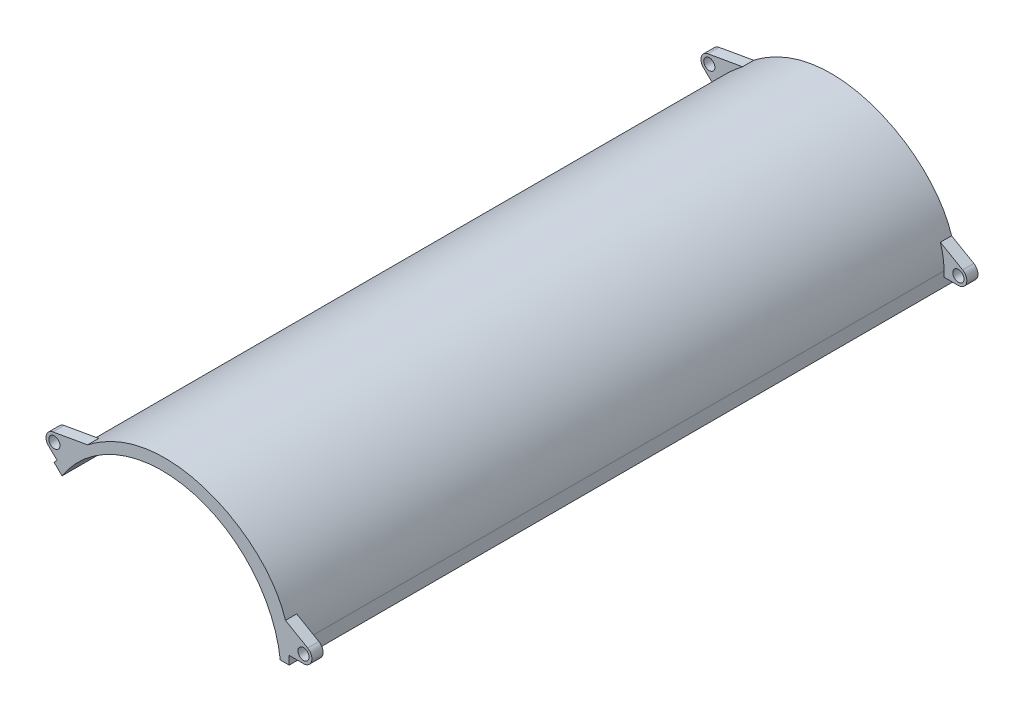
ISO-10303-21;
HEADER;
FILE_DESCRIPTION(('STEP AP214'),'2;1');
FILE_NAME('part.step','',(''),(''),'','','');
FILE_SCHEMA(('AUTOMOTIVE_DESIGN { 1 0 10303 214 1 1 1 1 }'));
ENDSEC;
DATA;
#1=APPLICATION_CONTEXT('core data for automotive mechanical design processes');
#2=APPLICATION_PROTOCOL_DEFINITION('international standard','automotive_design',2000,#1);
#3=PRODUCT_CONTEXT('',#1,'mechanical');
#4=PRODUCT('Part','Part','',(#3));
#5=PRODUCT_RELATED_PRODUCT_CATEGORY('part','',(#4));
#6=PRODUCT_DEFINITION_FORMATION('','',#4);
#7=PRODUCT_DEFINITION_CONTEXT('part definition',#1,'design');
#8=PRODUCT_DEFINITION('design','',#6,#7);
#9=PRODUCT_DEFINITION_SHAPE('','',#8);
#10=(LENGTH_UNIT() NAMED_UNIT(*) SI_UNIT(.MILLI.,.METRE.));
#11=(NAMED_UNIT(*) PLANE_ANGLE_UNIT() SI_UNIT($,.RADIAN.));
#12=(NAMED_UNIT(*) SI_UNIT($,.STERADIAN.) SOLID_ANGLE_UNIT());
#13=UNCERTAINTY_MEASURE_WITH_UNIT(LENGTH_MEASURE(1.E-05),#10,'distance_accuracy_value','');
#14=(GEOMETRIC_REPRESENTATION_CONTEXT(3) GLOBAL_UNCERTAINTY_ASSIGNED_CONTEXT((#13)) GLOBAL_UNIT_ASSIGNED_CONTEXT((#10,
#11,#12)) REPRESENTATION_CONTEXT('',''));
#15=CARTESIAN_POINT('',(0.,0.,0.));
#16=DIRECTION('',(0.,0.,1.));
#17=DIRECTION('',(1.,0.,0.));
#18=AXIS2_PLACEMENT_3D('',#15,#16,#17);
#19=CARTESIAN_POINT('',(252.5,1.52655665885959E-13,595.));
#20=DIRECTION('',(0.,0.,-1.));
#21=DIRECTION('',(-1.,0.,0.));
#22=AXIS2_PLACEMENT_3D('',#19,#20,#21);
#23=CYLINDRICAL_SURFACE('',#22,212.5);
#24=CARTESIAN_POINT('',(252.5,1.52655665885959E-13,-595.));
#25=DIRECTION('',(0.,0.,-1.));
#26=DIRECTION('',(-1.,0.,0.));
#27=AXIS2_PLACEMENT_3D('',#24,#25,#26);
#28=CIRCLE('',#27,212.5);
#29=CARTESIAN_POINT('',(73.7413758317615,114.898234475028,-595.));
#30=VERTEX_POINT('',#29);
#31=CARTESIAN_POINT('',(463.524287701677,25.,-595.));
#32=VERTEX_POINT('',#31);
#33=EDGE_CURVE('E337',#30,#32,#28,.T.);
#34=ORIENTED_EDGE('',*,*,#33,.T.);
#35=DIRECTION('',(0.,0.,-1.));
#36=VECTOR('',#35,1.);
#37=CARTESIAN_POINT('',(463.524287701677,25.,595.));
#38=LINE('',#37,#36);
#39=CARTESIAN_POINT('',(463.524287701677,25.,595.));
#40=VERTEX_POINT('',#39);
#41=EDGE_CURVE('E11',#40,#32,#38,.T.);
#42=ORIENTED_EDGE('',*,*,#41,.F.);
#43=CARTESIAN_POINT('',(252.5,1.52655665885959E-13,595.));
#44=DIRECTION('',(0.,0.,-1.));
#45=DIRECTION('',(-1.,0.,0.));
#46=AXIS2_PLACEMENT_3D('',#43,#44,#45);
#47=CIRCLE('',#46,212.5);
#48=CARTESIAN_POINT('',(73.7413758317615,114.898234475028,595.));
#49=VERTEX_POINT('',#48);
#50=EDGE_CURVE('E338',#49,#40,#47,.T.);
#51=ORIENTED_EDGE('',*,*,#50,.F.);
#52=DIRECTION('',(0.,0.,-1.));
#53=VECTOR('',#52,1.);
#54=CARTESIAN_POINT('',(73.7413758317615,114.898234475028,595.));
#55=LINE('',#54,#53);
#56=EDGE_CURVE('E394',#49,#30,#55,.T.);
#57=ORIENTED_EDGE('',*,*,#56,.T.);
#58=EDGE_LOOP('',(#34,#42,#51,#57));
#59=FACE_BOUND('',#58,.T.);
#60=ADVANCED_FACE('F41',(#59),#23,.F.);
#61=CARTESIAN_POINT('',(463.524287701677,25.,595.));
#62=DIRECTION('',(0.,1.,0.));
#63=DIRECTION('',(0.,0.,1.));
#64=AXIS2_PLACEMENT_3D('',#61,#62,#63);
#65=PLANE('',#64);
#66=DIRECTION('',(1.,0.,0.));
#67=VECTOR('',#66,1.);
#68=CARTESIAN_POINT('',(463.524287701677,25.,-595.));
#69=LINE('',#68,#67);
#70=CARTESIAN_POINT('',(479.524287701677,25.,-595.));
#71=VERTEX_POINT('',#70);
#72=EDGE_CURVE('E450',#32,#71,#69,.T.);
#73=ORIENTED_EDGE('',*,*,#72,.T.);
#74=DIRECTION('',(0.,0.,-1.));
#75=VECTOR('',#74,1.);
#76=CARTESIAN_POINT('',(479.524287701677,25.,595.));
#77=LINE('',#76,#75);
#78=CARTESIAN_POINT('',(479.524287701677,25.,595.));
#79=VERTEX_POINT('',#78);
#80=EDGE_CURVE('E49',#79,#71,#77,.T.);
#81=ORIENTED_EDGE('',*,*,#80,.F.);
#82=DIRECTION('',(1.,0.,0.));
#83=VECTOR('',#82,1.);
#84=CARTESIAN_POINT('',(463.524287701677,25.,595.));
#85=LINE('',#84,#83);
#86=EDGE_CURVE('E341',#40,#79,#85,.T.);
#87=ORIENTED_EDGE('',*,*,#86,.F.);
#88=ORIENTED_EDGE('',*,*,#41,.T.);
#89=EDGE_LOOP('',(#73,#81,#87,#88));
#90=FACE_BOUND('',#89,.T.);
#91=ADVANCED_FACE('F438',(#90),#65,.F.);
#92=CARTESIAN_POINT('',(479.524287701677,25.,595.));
#93=DIRECTION('',(-1.,0.,0.));
#94=DIRECTION('',(0.,-1.,0.));
#95=AXIS2_PLACEMENT_3D('',#92,#93,#94);
#96=PLANE('',#95);
#97=DIRECTION('',(0.,-1.,0.));
#98=VECTOR('',#97,1.);
#99=CARTESIAN_POINT('',(479.524287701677,50.0000000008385,575.));
#100=LINE('',#99,#98);
#101=CARTESIAN_POINT('',(479.524287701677,50.0000000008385,575.));
#102=VERTEX_POINT('',#101);
#103=CARTESIAN_POINT('',(479.524287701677,40.,575.));
#104=VERTEX_POINT('',#103);
#105=EDGE_CURVE('E255',#102,#104,#100,.T.);
#106=ORIENTED_EDGE('',*,*,#105,.T.);
#107=DIRECTION('',(0.,0.,1.));
#108=VECTOR('',#107,1.);
#109=CARTESIAN_POINT('',(479.524287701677,40.,575.));
#110=LINE('',#109,#108);
#111=CARTESIAN_POINT('',(479.524287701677,40.,595.));
#112=VERTEX_POINT('',#111);
#113=EDGE_CURVE('E261',#104,#112,#110,.T.);
#114=ORIENTED_EDGE('',*,*,#113,.T.);
#115=DIRECTION('',(0.,1.,0.));
#116=VECTOR('',#115,1.);
#117=CARTESIAN_POINT('',(479.524287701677,25.,595.));
#118=LINE('',#117,#116);
#119=EDGE_CURVE('E344',#79,#112,#118,.T.);
#120=ORIENTED_EDGE('',*,*,#119,.F.);
#121=ORIENTED_EDGE('',*,*,#80,.T.);
#122=DIRECTION('',(0.,1.,0.));
#123=VECTOR('',#122,1.);
#124=CARTESIAN_POINT('',(479.524287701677,25.,-595.));
#125=LINE('',#124,#123);
#126=CARTESIAN_POINT('',(479.524287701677,40.,-595.));
#127=VERTEX_POINT('',#126);
#128=EDGE_CURVE('E381',#71,#127,#125,.T.);
#129=ORIENTED_EDGE('',*,*,#128,.T.);
#130=DIRECTION('',(0.,0.,-1.));
#131=VECTOR('',#130,1.);
#132=CARTESIAN_POINT('',(479.524287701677,40.,-575.));
#133=LINE('',#132,#131);
#134=CARTESIAN_POINT('',(479.524287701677,40.,-575.));
#135=VERTEX_POINT('',#134);
#136=EDGE_CURVE('E334',#135,#127,#133,.T.);
#137=ORIENTED_EDGE('',*,*,#136,.F.);
#138=DIRECTION('',(0.,1.,0.));
#139=VECTOR('',#138,1.);
#140=CARTESIAN_POINT('',(479.524287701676,-1.107582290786E-12,-575.));
#141=LINE('',#140,#139);
#142=CARTESIAN_POINT('',(479.524287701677,50.,-575.));
#143=VERTEX_POINT('',#142);
#144=EDGE_CURVE('E317',#135,#143,#141,.T.);
#145=ORIENTED_EDGE('',*,*,#144,.T.);
#146=DIRECTION('',(0.,0.,-1.));
#147=VECTOR('',#146,1.);
#148=CARTESIAN_POINT('',(479.524287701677,50.,595.));
#149=LINE('',#148,#147);
#150=EDGE_CURVE('E366',#102,#143,#149,.T.);
#151=ORIENTED_EDGE('',*,*,#150,.F.);
#152=EDGE_LOOP('',(#106,#114,#120,#121,#129,#137,#145,#151));
#153=FACE_BOUND('',#152,.T.);
#154=ADVANCED_FACE('F443',(#153),#96,.F.);
#155=CARTESIAN_POINT('',(479.524287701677,50.,595.));
#156=CARTESIAN_POINT('',(477.15378099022,170.567422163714,595.));
#157=CARTESIAN_POINT('',(359.356081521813,236.563554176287,595.));
#158=CARTESIAN_POINT('',(287.408844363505,253.328836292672,595.));
#159=CARTESIAN_POINT('',(219.133886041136,251.435560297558,595.));
#160=CARTESIAN_POINT('',(152.416815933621,225.58654086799,595.));
#161=CARTESIAN_POINT('',(108.187547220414,179.583185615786,595.));
#162=CARTESIAN_POINT('',(69.7200278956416,139.572690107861,595.));
#163=B_SPLINE_CURVE_WITH_KNOTS('',7,(#155,#156,#157,#158,#159,#160,#161,#162),.UNSPECIFIED.,.F.,
.F.,(8,8),(0.,1.),.UNSPECIFIED.);
#164=DIRECTION('',(0.,0.,-1.));
#165=VECTOR('',#164,1.);
#166=SURFACE_OF_LINEAR_EXTRUSION('',#163,#165);
#167=CARTESIAN_POINT('',(69.7200278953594,139.572690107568,575.));
#168=CARTESIAN_POINT('',(76.0741492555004,146.181682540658,575.));
#169=CARTESIAN_POINT('',(82.5854794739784,152.954189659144,575.));
#170=CARTESIAN_POINT('',(89.3294022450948,159.772367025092,575.));
#171=CARTESIAN_POINT('',(96.3532676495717,166.535005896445,575.));
#172=CARTESIAN_POINT('',(103.683856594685,173.1559041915,575.));
#173=CARTESIAN_POINT('',(111.333957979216,179.561593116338,575.));
#174=CARTESIAN_POINT('',(119.307330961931,185.688881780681,575.));
#175=B_SPLINE_CURVE_WITH_KNOTS('',7,(#167,#168,#169,#170,#171,#172,#173,#174),.UNSPECIFIED.,.F.,
.F.,(8,8),(0.,0.165181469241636),.UNSPECIFIED.);
#176=CARTESIAN_POINT('',(69.7200278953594,139.572690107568,575.));
#177=VERTEX_POINT('',#176);
#178=CARTESIAN_POINT('',(119.307330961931,185.688881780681,575.));
#179=VERTEX_POINT('',#178);
#180=EDGE_CURVE('E209',#177,#179,#175,.T.);
#181=ORIENTED_EDGE('',*,*,#180,.T.);
#182=DIRECTION('',(0.,0.,1.));
#183=VECTOR('',#182,1.);
#184=CARTESIAN_POINT('',(119.307330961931,185.688881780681,575.));
#185=LINE('',#184,#183);
#186=CARTESIAN_POINT('',(119.307330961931,185.688881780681,595.));
#187=VERTEX_POINT('',#186);
#188=EDGE_CURVE('E193',#179,#187,#185,.T.);
#189=ORIENTED_EDGE('',*,*,#188,.T.);
#190=CARTESIAN_POINT('',(472.826933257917,90.8956368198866,595.));
#191=VERTEX_POINT('',#190);
#192=EDGE_CURVE('E347',#191,#187,#163,.T.);
#193=ORIENTED_EDGE('',*,*,#192,.F.);
#194=DIRECTION('',(0.,0.,1.));
#195=VECTOR('',#194,1.);
#196=CARTESIAN_POINT('',(472.826933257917,90.8956368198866,575.));
#197=LINE('',#196,#195);
#198=CARTESIAN_POINT('',(472.826933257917,90.8956368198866,575.));
#199=VERTEX_POINT('',#198);
#200=EDGE_CURVE('E270',#199,#191,#197,.T.);
#201=ORIENTED_EDGE('',*,*,#200,.F.);
#202=CARTESIAN_POINT('',(472.826933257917,90.8956368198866,575.));
#203=CARTESIAN_POINT('',(474.517057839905,85.4877859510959,575.));
#204=CARTESIAN_POINT('',(475.993797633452,79.9371958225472,575.));
#205=CARTESIAN_POINT('',(477.239796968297,74.2424995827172,575.));
#206=CARTESIAN_POINT('',(478.236465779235,68.4024521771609,575.));
#207=CARTESIAN_POINT('',(478.963896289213,62.4159497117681,575.));
#208=CARTESIAN_POINT('',(479.40077470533,56.2820507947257,575.));
#209=CARTESIAN_POINT('',(479.524287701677,50.0000000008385,575.));
#210=B_SPLINE_CURVE_WITH_KNOTS('',7,(#202,#203,#204,#205,#206,#207,#208,#209),.UNSPECIFIED.,.F.,
.F.,(8,8),(0.94789595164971,1.),.UNSPECIFIED.);
#211=EDGE_CURVE('E475',#199,#102,#210,.T.);
#212=ORIENTED_EDGE('',*,*,#211,.T.);
#213=ORIENTED_EDGE('',*,*,#150,.T.);
#214=CARTESIAN_POINT('',(472.826933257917,90.8956368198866,-575.));
#215=CARTESIAN_POINT('',(474.517057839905,85.4877859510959,-575.));
#216=CARTESIAN_POINT('',(475.993797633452,79.9371958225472,-575.));
#217=CARTESIAN_POINT('',(477.239796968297,74.2424995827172,-575.));
#218=CARTESIAN_POINT('',(478.236465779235,68.4024521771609,-575.));
#219=CARTESIAN_POINT('',(478.963896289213,62.4159497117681,-575.));
#220=CARTESIAN_POINT('',(479.40077470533,56.2820507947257,-575.));
#221=CARTESIAN_POINT('',(479.524287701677,50.0000000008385,-575.));
#222=B_SPLINE_CURVE_WITH_KNOTS('',7,(#214,#215,#216,#217,#218,#219,#220,#221),.UNSPECIFIED.,.F.,
.F.,(8,8),(0.,1.),.UNSPECIFIED.);
#223=CARTESIAN_POINT('',(472.82693326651,90.895636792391,-575.));
#224=VERTEX_POINT('',#223);
#225=EDGE_CURVE('E580',#224,#143,#222,.T.);
#226=ORIENTED_EDGE('',*,*,#225,.F.);
#227=DIRECTION('',(0.,0.,-1.));
#228=VECTOR('',#227,1.);
#229=CARTESIAN_POINT('',(472.826933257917,90.8956368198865,-575.));
#230=LINE('',#229,#228);
#231=CARTESIAN_POINT('',(472.826933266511,90.8956367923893,-595.));
#232=VERTEX_POINT('',#231);
#233=EDGE_CURVE('E323',#224,#232,#230,.T.);
#234=ORIENTED_EDGE('',*,*,#233,.T.);
#235=CARTESIAN_POINT('',(479.524287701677,50.,-595.));
#236=CARTESIAN_POINT('',(477.15378099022,170.567422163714,-595.));
#237=CARTESIAN_POINT('',(359.356081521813,236.563554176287,-595.));
#238=CARTESIAN_POINT('',(287.408844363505,253.328836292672,-595.));
#239=CARTESIAN_POINT('',(219.133886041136,251.435560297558,-595.));
#240=CARTESIAN_POINT('',(152.416815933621,225.58654086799,-595.));
#241=CARTESIAN_POINT('',(108.187547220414,179.583185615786,-595.));
#242=CARTESIAN_POINT('',(69.7200278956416,139.572690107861,-595.));
#243=B_SPLINE_CURVE_WITH_KNOTS('',7,(#235,#236,#237,#238,#239,#240,#241,#242),.UNSPECIFIED.,.F.,
.F.,(8,8),(0.,1.),.UNSPECIFIED.);
#244=CARTESIAN_POINT('',(119.307330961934,185.688881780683,-595.));
#245=VERTEX_POINT('',#244);
#246=EDGE_CURVE('E377',#232,#245,#243,.T.);
#247=ORIENTED_EDGE('',*,*,#246,.T.);
#248=DIRECTION('',(0.,0.,-1.));
#249=VECTOR('',#248,1.);
#250=CARTESIAN_POINT('',(119.307330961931,185.688881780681,-575.));
#251=LINE('',#250,#249);
#252=CARTESIAN_POINT('',(119.307330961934,185.688881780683,-575.));
#253=VERTEX_POINT('',#252);
#254=EDGE_CURVE('E65',#253,#245,#251,.T.);
#255=ORIENTED_EDGE('',*,*,#254,.F.);
#256=CARTESIAN_POINT('',(69.7200278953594,139.572690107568,-575.));
#257=CARTESIAN_POINT('',(76.0741492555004,146.181682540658,-575.));
#258=CARTESIAN_POINT('',(82.5854794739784,152.954189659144,-575.));
#259=CARTESIAN_POINT('',(89.3294022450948,159.772367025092,-575.));
#260=CARTESIAN_POINT('',(96.3532676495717,166.535005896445,-575.));
#261=CARTESIAN_POINT('',(103.683856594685,173.1559041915,-575.));
#262=CARTESIAN_POINT('',(111.333957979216,179.561593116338,-575.));
#263=CARTESIAN_POINT('',(119.307330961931,185.688881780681,-575.));
#264=B_SPLINE_CURVE_WITH_KNOTS('',7,(#256,#257,#258,#259,#260,#261,#262,#263),.UNSPECIFIED.,.F.,
.F.,(8,8),(0.,1.),.UNSPECIFIED.);
#265=CARTESIAN_POINT('',(69.7200278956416,139.572690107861,-575.));
#266=VERTEX_POINT('',#265);
#267=EDGE_CURVE('E278',#266,#253,#264,.T.);
#268=ORIENTED_EDGE('',*,*,#267,.F.);
#269=DIRECTION('',(0.,0.,-1.));
#270=VECTOR('',#269,1.);
#271=CARTESIAN_POINT('',(69.7200278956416,139.572690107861,595.));
#272=LINE('',#271,#270);
#273=EDGE_CURVE('E217',#177,#266,#272,.T.);
#274=ORIENTED_EDGE('',*,*,#273,.F.);
#275=EDGE_LOOP('',(#181,#189,#193,#201,#212,#213,#226,#234,#247,#255,#268,#274));
#276=FACE_BOUND('',#275,.T.);
#277=ADVANCED_FACE('F216',(#276),#166,.F.);
#278=CARTESIAN_POINT('',(59.3239744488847,128.759639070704,595.));
#279=DIRECTION('',(0.720870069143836,-0.693070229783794,0.));
#280=DIRECTION('',(0.693070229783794,0.720870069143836,0.));
#281=AXIS2_PLACEMENT_3D('',#278,#279,#280);
#282=PLANE('',#281);
#283=DIRECTION('',(-0.693070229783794,-0.720870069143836,0.));
#284=VECTOR('',#283,1.);
#285=CARTESIAN_POINT('',(59.3239744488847,128.759639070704,595.));
#286=LINE('',#285,#284);
#287=CARTESIAN_POINT('',(64.8607561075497,134.51850737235,595.));
#288=VERTEX_POINT('',#287);
#289=CARTESIAN_POINT('',(59.3239744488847,128.759639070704,595.));
#290=VERTEX_POINT('',#289);
#291=EDGE_CURVE('E352',#288,#290,#286,.T.);
#292=ORIENTED_EDGE('',*,*,#291,.F.);
#293=DIRECTION('',(0.,0.,1.));
#294=VECTOR('',#293,1.);
#295=CARTESIAN_POINT('',(64.8607561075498,134.51850737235,575.));
#296=LINE('',#295,#294);
#297=CARTESIAN_POINT('',(64.8607561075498,134.51850737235,575.));
#298=VERTEX_POINT('',#297);
#299=EDGE_CURVE('E239',#298,#288,#296,.T.);
#300=ORIENTED_EDGE('',*,*,#299,.F.);
#301=DIRECTION('',(0.693070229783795,0.720870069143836,0.));
#302=VECTOR('',#301,1.);
#303=CARTESIAN_POINT('',(64.8607561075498,134.51850737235,575.));
#304=LINE('',#303,#302);
#305=EDGE_CURVE('E203',#298,#177,#304,.T.);
#306=ORIENTED_EDGE('',*,*,#305,.T.);
#307=ORIENTED_EDGE('',*,*,#273,.T.);
#308=DIRECTION('',(-0.693070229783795,-0.720870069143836,0.));
#309=VECTOR('',#308,1.);
#310=CARTESIAN_POINT('',(87.7853071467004,158.362588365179,-575.));
#311=LINE('',#310,#309);
#312=CARTESIAN_POINT('',(64.8607561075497,134.51850737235,-575.));
#313=VERTEX_POINT('',#312);
#314=EDGE_CURVE('E300',#266,#313,#311,.T.);
#315=ORIENTED_EDGE('',*,*,#314,.T.);
#316=DIRECTION('',(0.,0.,-1.));
#317=VECTOR('',#316,1.);
#318=CARTESIAN_POINT('',(64.8607561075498,134.51850737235,-575.));
#319=LINE('',#318,#317);
#320=CARTESIAN_POINT('',(64.8607561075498,134.51850737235,-595.));
#321=VERTEX_POINT('',#320);
#322=EDGE_CURVE('E275',#313,#321,#319,.T.);
#323=ORIENTED_EDGE('',*,*,#322,.T.);
#324=DIRECTION('',(-0.693070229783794,-0.720870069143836,0.));
#325=VECTOR('',#324,1.);
#326=CARTESIAN_POINT('',(59.3239744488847,128.759639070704,-595.));
#327=LINE('',#326,#325);
#328=CARTESIAN_POINT('',(59.3239744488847,128.759639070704,-595.));
#329=VERTEX_POINT('',#328);
#330=EDGE_CURVE('E380',#321,#329,#327,.T.);
#331=ORIENTED_EDGE('',*,*,#330,.T.);
#332=DIRECTION('',(0.,0.,-1.));
#333=VECTOR('',#332,1.);
#334=CARTESIAN_POINT('',(59.3239744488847,128.759639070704,595.));
#335=LINE('',#334,#333);
#336=EDGE_CURVE('E396',#290,#329,#335,.T.);
#337=ORIENTED_EDGE('',*,*,#336,.F.);
#338=EDGE_LOOP('',(#292,#300,#306,#307,#315,#323,#331,#337));
#339=FACE_BOUND('',#338,.T.);
#340=ADVANCED_FACE('F433',(#339),#282,.F.);
#341=CARTESIAN_POINT('',(59.3239744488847,128.759639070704,595.));
#342=DIRECTION('',(0.693070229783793,0.720870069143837,0.));
#343=DIRECTION('',(-0.720870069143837,0.693070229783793,0.));
#344=AXIS2_PLACEMENT_3D('',#341,#342,#343);
#345=PLANE('',#344);
#346=DIRECTION('',(0.720870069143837,-0.693070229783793,0.));
#347=VECTOR('',#346,1.);
#348=CARTESIAN_POINT('',(59.3239744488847,128.759639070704,-595.));
#349=LINE('',#348,#347);
#350=EDGE_CURVE('E342',#329,#30,#349,.T.);
#351=ORIENTED_EDGE('',*,*,#350,.T.);
#352=ORIENTED_EDGE('',*,*,#56,.F.);
#353=DIRECTION('',(0.720870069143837,-0.693070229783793,0.));
#354=VECTOR('',#353,1.);
#355=CARTESIAN_POINT('',(59.3239744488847,128.759639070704,595.));
#356=LINE('',#355,#354);
#357=EDGE_CURVE('E397',#290,#49,#356,.T.);
#358=ORIENTED_EDGE('',*,*,#357,.F.);
#359=ORIENTED_EDGE('',*,*,#336,.T.);
#360=EDGE_LOOP('',(#351,#352,#358,#359));
#361=FACE_BOUND('',#360,.T.);
#362=ADVANCED_FACE('F424',(#361),#345,.F.);
#363=CARTESIAN_POINT('',(252.5,1.52655665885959E-13,595.));
#364=DIRECTION('',(0.,0.,-1.));
#365=DIRECTION('',(-1.,0.,0.));
#366=AXIS2_PLACEMENT_3D('',#363,#364,#365);
#367=PLANE('',#366);
#368=ORIENTED_EDGE('',*,*,#192,.T.);
#369=DIRECTION('',(-0.984807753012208,-0.173648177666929,0.));
#370=VECTOR('',#369,1.);
#371=CARTESIAN_POINT('',(57.3952773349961,174.772116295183,595.));
#372=LINE('',#371,#370);
#373=CARTESIAN_POINT('',(57.3952773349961,174.772116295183,595.));
#374=VERTEX_POINT('',#373);
#375=EDGE_CURVE('E198',#187,#374,#372,.T.);
#376=ORIENTED_EDGE('',*,*,#375,.T.);
#377=CARTESIAN_POINT('',(60.0000000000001,160.,595.));
#378=DIRECTION('',(0.,0.,1.));
#379=DIRECTION('',(-1.,0.,0.));
#380=AXIS2_PLACEMENT_3D('',#377,#378,#379);
#381=CIRCLE('',#380,15.);
#382=CARTESIAN_POINT('',(49.6039465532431,149.186948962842,595.));
#383=VERTEX_POINT('',#382);
#384=EDGE_CURVE('E219',#374,#383,#381,.T.);
#385=ORIENTED_EDGE('',*,*,#384,.T.);
#386=DIRECTION('',(0.720870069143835,-0.693070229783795,0.));
#387=VECTOR('',#386,1.);
#388=CARTESIAN_POINT('',(49.6039465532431,149.186948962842,595.));
#389=LINE('',#388,#387);
#390=EDGE_CURVE('E57',#383,#288,#389,.T.);
#391=ORIENTED_EDGE('',*,*,#390,.T.);
#392=ORIENTED_EDGE('',*,*,#291,.T.);
#393=ORIENTED_EDGE('',*,*,#357,.T.);
#394=ORIENTED_EDGE('',*,*,#50,.T.);
#395=ORIENTED_EDGE('',*,*,#86,.T.);
#396=ORIENTED_EDGE('',*,*,#119,.T.);
#397=DIRECTION('',(1.,0.,0.));
#398=VECTOR('',#397,1.);
#399=CARTESIAN_POINT('',(505.,40.,595.));
#400=LINE('',#399,#398);
#401=CARTESIAN_POINT('',(505.,40.,595.));
#402=VERTEX_POINT('',#401);
#403=EDGE_CURVE('E248',#112,#402,#400,.T.);
#404=ORIENTED_EDGE('',*,*,#403,.T.);
#405=CARTESIAN_POINT('',(505.,55.,595.));
#406=DIRECTION('',(0.,0.,1.));
#407=DIRECTION('',(-1.,0.,0.));
#408=AXIS2_PLACEMENT_3D('',#405,#406,#407);
#409=CIRCLE('',#408,15.);
#410=CARTESIAN_POINT('',(512.5,67.9903810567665,595.));
#411=VERTEX_POINT('',#410);
#412=EDGE_CURVE('E264',#402,#411,#409,.T.);
#413=ORIENTED_EDGE('',*,*,#412,.T.);
#414=DIRECTION('',(-0.866025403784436,0.500000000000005,0.));
#415=VECTOR('',#414,1.);
#416=CARTESIAN_POINT('',(512.5,67.9903810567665,595.));
#417=LINE('',#416,#415);
#418=EDGE_CURVE('E267',#411,#191,#417,.T.);
#419=ORIENTED_EDGE('',*,*,#418,.T.);
#420=EDGE_LOOP('',(#368,#376,#385,#391,#392,#393,#394,#395,#396,#404,#413,#419));
#421=FACE_BOUND('',#420,.T.);
#422=CARTESIAN_POINT('',(505.,55.,595.));
#423=DIRECTION('',(0.,0.,1.));
#424=DIRECTION('',(-1.,0.,0.));
#425=AXIS2_PLACEMENT_3D('',#422,#423,#424);
#426=CIRCLE('',#425,9.99999999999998);
#427=CARTESIAN_POINT('',(495.,55.,595.));
#428=VERTEX_POINT('',#427);
#429=EDGE_CURVE('E241',#428,#428,#426,.T.);
#430=ORIENTED_EDGE('',*,*,#429,.F.);
#431=EDGE_LOOP('',(#430));
#432=FACE_BOUND('',#431,.T.);
#433=CARTESIAN_POINT('',(60.0000000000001,160.,595.));
#434=DIRECTION('',(0.,0.,1.));
#435=DIRECTION('',(-1.,0.,0.));
#436=AXIS2_PLACEMENT_3D('',#433,#434,#435);
#437=CIRCLE('',#436,9.99999999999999);
#438=CARTESIAN_POINT('',(50.0000000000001,160.,595.));
#439=VERTEX_POINT('',#438);
#440=EDGE_CURVE('E411',#439,#439,#437,.T.);
#441=ORIENTED_EDGE('',*,*,#440,.F.);
#442=EDGE_LOOP('',(#441));
#443=FACE_BOUND('',#442,.T.);
#444=ADVANCED_FACE('F421',(#421,#432,#443),#367,.F.);
#445=CARTESIAN_POINT('',(252.5,1.52655665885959E-13,-595.));
#446=DIRECTION('',(0.,0.,-1.));
#447=DIRECTION('',(-1.,0.,0.));
#448=AXIS2_PLACEMENT_3D('',#445,#446,#447);
#449=PLANE('',#448);
#450=DIRECTION('',(0.984807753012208,0.173648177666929,0.));
#451=VECTOR('',#450,1.);
#452=CARTESIAN_POINT('',(216.729080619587,202.866964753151,-595.));
#453=LINE('',#452,#451);
#454=CARTESIAN_POINT('',(57.3952773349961,174.772116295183,-595.));
#455=VERTEX_POINT('',#454);
#456=EDGE_CURVE('E287',#455,#245,#453,.T.);
#457=ORIENTED_EDGE('',*,*,#456,.T.);
#458=ORIENTED_EDGE('',*,*,#246,.F.);
#459=DIRECTION('',(0.866025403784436,-0.500000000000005,0.));
#460=VECTOR('',#459,1.);
#461=CARTESIAN_POINT('',(346.940698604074,163.576088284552,-595.));
#462=LINE('',#461,#460);
#463=CARTESIAN_POINT('',(512.5,67.9903810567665,-595.));
#464=VERTEX_POINT('',#463);
#465=EDGE_CURVE('E329',#232,#464,#462,.T.);
#466=ORIENTED_EDGE('',*,*,#465,.T.);
#467=CARTESIAN_POINT('',(505.,55.,-595.));
#468=DIRECTION('',(0.,0.,-1.));
#469=DIRECTION('',(-1.,0.,0.));
#470=AXIS2_PLACEMENT_3D('',#467,#468,#469);
#471=CIRCLE('',#470,15.);
#472=CARTESIAN_POINT('',(505.,40.,-595.));
#473=VERTEX_POINT('',#472);
#474=EDGE_CURVE('E326',#464,#473,#471,.T.);
#475=ORIENTED_EDGE('',*,*,#474,.T.);
#476=DIRECTION('',(-1.,0.,0.));
#477=VECTOR('',#476,1.);
#478=CARTESIAN_POINT('',(252.5,40.,-595.));
#479=LINE('',#478,#477);
#480=EDGE_CURVE('E310',#473,#127,#479,.T.);
#481=ORIENTED_EDGE('',*,*,#480,.T.);
#482=ORIENTED_EDGE('',*,*,#128,.F.);
#483=ORIENTED_EDGE('',*,*,#72,.F.);
#484=ORIENTED_EDGE('',*,*,#33,.F.);
#485=ORIENTED_EDGE('',*,*,#350,.F.);
#486=ORIENTED_EDGE('',*,*,#330,.F.);
#487=DIRECTION('',(-0.720870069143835,0.693070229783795,0.));
#488=VECTOR('',#487,1.);
#489=CARTESIAN_POINT('',(229.575448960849,-23.8440809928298,-595.));
#490=LINE('',#489,#488);
#491=CARTESIAN_POINT('',(49.6039465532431,149.186948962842,-595.));
#492=VERTEX_POINT('',#491);
#493=EDGE_CURVE('E286',#321,#492,#490,.T.);
#494=ORIENTED_EDGE('',*,*,#493,.T.);
#495=CARTESIAN_POINT('',(60.0000000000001,160.,-595.));
#496=DIRECTION('',(0.,0.,-1.));
#497=DIRECTION('',(-1.,0.,0.));
#498=AXIS2_PLACEMENT_3D('',#495,#496,#497);
#499=CIRCLE('',#498,15.);
#500=EDGE_CURVE('E283',#492,#455,#499,.T.);
#501=ORIENTED_EDGE('',*,*,#500,.T.);
#502=EDGE_LOOP('',(#457,#458,#466,#475,#481,#482,#483,#484,#485,#486,#494,#501));
#503=FACE_BOUND('',#502,.T.);
#504=CARTESIAN_POINT('',(505.,55.,-595.));
#505=DIRECTION('',(0.,0.,-1.));
#506=DIRECTION('',(-1.,0.,0.));
#507=AXIS2_PLACEMENT_3D('',#504,#505,#506);
#508=CIRCLE('',#507,9.99999999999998);
#509=CARTESIAN_POINT('',(495.,55.,-595.));
#510=VERTEX_POINT('',#509);
#511=EDGE_CURVE('E304',#510,#510,#508,.T.);
#512=ORIENTED_EDGE('',*,*,#511,.F.);
#513=EDGE_LOOP('',(#512));
#514=FACE_BOUND('',#513,.T.);
#515=CARTESIAN_POINT('',(60.0000000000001,160.,-595.));
#516=DIRECTION('',(0.,0.,-1.));
#517=DIRECTION('',(-1.,0.,0.));
#518=AXIS2_PLACEMENT_3D('',#515,#516,#517);
#519=CIRCLE('',#518,9.99999999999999);
#520=CARTESIAN_POINT('',(50.0000000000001,160.,-595.));
#521=VERTEX_POINT('',#520);
#522=EDGE_CURVE('E301',#521,#521,#519,.T.);
#523=ORIENTED_EDGE('',*,*,#522,.F.);
#524=EDGE_LOOP('',(#523));
#525=FACE_BOUND('',#524,.T.);
#526=ADVANCED_FACE('F423',(#503,#514,#525),#449,.T.);
#527=CARTESIAN_POINT('',(252.5,40.,-575.));
#528=DIRECTION('',(0.,-1.,0.));
#529=DIRECTION('',(0.,0.,-1.));
#530=AXIS2_PLACEMENT_3D('',#527,#528,#529);
#531=PLANE('',#530);
#532=ORIENTED_EDGE('',*,*,#480,.F.);
#533=DIRECTION('',(0.,0.,-1.));
#534=VECTOR('',#533,1.);
#535=CARTESIAN_POINT('',(505.,40.,-575.));
#536=LINE('',#535,#534);
#537=CARTESIAN_POINT('',(505.,40.,-575.));
#538=VERTEX_POINT('',#537);
#539=EDGE_CURVE('E332',#538,#473,#536,.T.);
#540=ORIENTED_EDGE('',*,*,#539,.F.);
#541=DIRECTION('',(-1.,0.,0.));
#542=VECTOR('',#541,1.);
#543=CARTESIAN_POINT('',(252.5,40.,-575.));
#544=LINE('',#543,#542);
#545=EDGE_CURVE('E313',#538,#135,#544,.T.);
#546=ORIENTED_EDGE('',*,*,#545,.T.);
#547=ORIENTED_EDGE('',*,*,#136,.T.);
#548=EDGE_LOOP('',(#532,#540,#546,#547));
#549=FACE_BOUND('',#548,.T.);
#550=ADVANCED_FACE('F430',(#549),#531,.T.);
#551=CARTESIAN_POINT('',(505.,55.,-575.));
#552=DIRECTION('',(0.,0.,-1.));
#553=DIRECTION('',(-1.,0.,0.));
#554=AXIS2_PLACEMENT_3D('',#551,#552,#553);
#555=CYLINDRICAL_SURFACE('',#554,15.);
#556=ORIENTED_EDGE('',*,*,#474,.F.);
#557=DIRECTION('',(0.,0.,-1.));
#558=VECTOR('',#557,1.);
#559=CARTESIAN_POINT('',(512.5,67.9903810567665,-575.));
#560=LINE('',#559,#558);
#561=CARTESIAN_POINT('',(512.5,67.9903810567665,-575.));
#562=VERTEX_POINT('',#561);
#563=EDGE_CURVE('E330',#562,#464,#560,.T.);
#564=ORIENTED_EDGE('',*,*,#563,.F.);
#565=CARTESIAN_POINT('',(505.,55.,-575.));
#566=DIRECTION('',(0.,0.,-1.));
#567=DIRECTION('',(-1.,0.,0.));
#568=AXIS2_PLACEMENT_3D('',#565,#566,#567);
#569=CIRCLE('',#568,15.);
#570=EDGE_CURVE('E316',#562,#538,#569,.T.);
#571=ORIENTED_EDGE('',*,*,#570,.T.);
#572=ORIENTED_EDGE('',*,*,#539,.T.);
#573=EDGE_LOOP('',(#556,#564,#571,#572));
#574=FACE_BOUND('',#573,.T.);
#575=ADVANCED_FACE('F553',(#574),#555,.T.);
#576=CARTESIAN_POINT('',(346.940698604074,163.576088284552,-575.));
#577=DIRECTION('',(0.500000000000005,0.866025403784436,0.));
#578=DIRECTION('',(-0.866025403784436,0.500000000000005,0.));
#579=AXIS2_PLACEMENT_3D('',#576,#577,#578);
#580=PLANE('',#579);
#581=ORIENTED_EDGE('',*,*,#465,.F.);
#582=ORIENTED_EDGE('',*,*,#233,.F.);
#583=DIRECTION('',(0.866025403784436,-0.500000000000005,0.));
#584=VECTOR('',#583,1.);
#585=CARTESIAN_POINT('',(346.940698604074,163.576088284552,-575.));
#586=LINE('',#585,#584);
#587=EDGE_CURVE('E320',#224,#562,#586,.T.);
#588=ORIENTED_EDGE('',*,*,#587,.T.);
#589=ORIENTED_EDGE('',*,*,#563,.T.);
#590=EDGE_LOOP('',(#581,#582,#588,#589));
#591=FACE_BOUND('',#590,.T.);
#592=ADVANCED_FACE('F549',(#591),#580,.T.);
#593=CARTESIAN_POINT('',(477.54341263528,71.2130770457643,-575.));
#594=DIRECTION('',(0.,0.,1.));
#595=DIRECTION('',(1.,0.,0.));
#596=AXIS2_PLACEMENT_3D('',#593,#594,#595);
#597=PLANE('',#596);
#598=CARTESIAN_POINT('',(505.,55.,-575.));
#599=DIRECTION('',(0.,0.,-1.));
#600=DIRECTION('',(-1.,0.,0.));
#601=AXIS2_PLACEMENT_3D('',#598,#599,#600);
#602=CIRCLE('',#601,9.99999999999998);
#603=CARTESIAN_POINT('',(495.,55.,-575.));
#604=VERTEX_POINT('',#603);
#605=EDGE_CURVE('E307',#604,#604,#602,.T.);
#606=ORIENTED_EDGE('',*,*,#605,.T.);
#607=EDGE_LOOP('',(#606));
#608=FACE_BOUND('',#607,.T.);
#609=ORIENTED_EDGE('',*,*,#225,.T.);
#610=ORIENTED_EDGE('',*,*,#144,.F.);
#611=ORIENTED_EDGE('',*,*,#545,.F.);
#612=ORIENTED_EDGE('',*,*,#570,.F.);
#613=ORIENTED_EDGE('',*,*,#587,.F.);
#614=EDGE_LOOP('',(#609,#610,#611,#612,#613));
#615=FACE_BOUND('',#614,.T.);
#616=ADVANCED_FACE('F545',(#608,#615),#597,.T.);
#617=CARTESIAN_POINT('',(505.,55.,-575.));
#618=DIRECTION('',(0.,0.,-1.));
#619=DIRECTION('',(-1.,0.,0.));
#620=AXIS2_PLACEMENT_3D('',#617,#618,#619);
#621=CYLINDRICAL_SURFACE('',#620,9.99999999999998);
#622=ORIENTED_EDGE('',*,*,#605,.F.);
#623=EDGE_LOOP('',(#622));
#624=FACE_BOUND('',#623,.T.);
#625=ORIENTED_EDGE('',*,*,#511,.T.);
#626=EDGE_LOOP('',(#625));
#627=FACE_BOUND('',#626,.T.);
#628=ADVANCED_FACE('F541',(#624,#627),#621,.F.);
#629=CARTESIAN_POINT('',(216.729080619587,202.866964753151,-575.));
#630=DIRECTION('',(-0.173648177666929,0.984807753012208,0.));
#631=DIRECTION('',(-0.984807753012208,-0.173648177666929,0.));
#632=AXIS2_PLACEMENT_3D('',#629,#630,#631);
#633=PLANE('',#632);
#634=ORIENTED_EDGE('',*,*,#456,.F.);
#635=DIRECTION('',(0.,0.,-1.));
#636=VECTOR('',#635,1.);
#637=CARTESIAN_POINT('',(57.3952773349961,174.772116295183,-575.));
#638=LINE('',#637,#636);
#639=CARTESIAN_POINT('',(57.3952773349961,174.772116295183,-575.));
#640=VERTEX_POINT('',#639);
#641=EDGE_CURVE('E281',#640,#455,#638,.T.);
#642=ORIENTED_EDGE('',*,*,#641,.F.);
#643=DIRECTION('',(0.984807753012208,0.173648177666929,0.));
#644=VECTOR('',#643,1.);
#645=CARTESIAN_POINT('',(216.729080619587,202.866964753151,-575.));
#646=LINE('',#645,#644);
#647=EDGE_CURVE('E291',#640,#253,#646,.T.);
#648=ORIENTED_EDGE('',*,*,#647,.T.);
#649=ORIENTED_EDGE('',*,*,#254,.T.);
#650=EDGE_LOOP('',(#634,#642,#648,#649));
#651=FACE_BOUND('',#650,.T.);
#652=ADVANCED_FACE('F544',(#651),#633,.T.);
#653=CARTESIAN_POINT('',(60.0000000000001,160.,-575.));
#654=DIRECTION('',(0.,0.,-1.));
#655=DIRECTION('',(-1.,0.,0.));
#656=AXIS2_PLACEMENT_3D('',#653,#654,#655);
#657=CYLINDRICAL_SURFACE('',#656,15.);
#658=ORIENTED_EDGE('',*,*,#500,.F.);
#659=DIRECTION('',(0.,0.,-1.));
#660=VECTOR('',#659,1.);
#661=CARTESIAN_POINT('',(49.6039465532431,149.186948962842,-575.));
#662=LINE('',#661,#660);
#663=CARTESIAN_POINT('',(49.6039465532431,149.186948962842,-575.));
#664=VERTEX_POINT('',#663);
#665=EDGE_CURVE('E279',#664,#492,#662,.T.);
#666=ORIENTED_EDGE('',*,*,#665,.F.);
#667=CARTESIAN_POINT('',(60.0000000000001,160.,-575.));
#668=DIRECTION('',(0.,0.,-1.));
#669=DIRECTION('',(-1.,0.,0.));
#670=AXIS2_PLACEMENT_3D('',#667,#668,#669);
#671=CIRCLE('',#670,15.);
#672=EDGE_CURVE('E294',#664,#640,#671,.T.);
#673=ORIENTED_EDGE('',*,*,#672,.T.);
#674=ORIENTED_EDGE('',*,*,#641,.T.);
#675=EDGE_LOOP('',(#658,#666,#673,#674));
#676=FACE_BOUND('',#675,.T.);
#677=ADVANCED_FACE('F520',(#676),#657,.T.);
#678=CARTESIAN_POINT('',(229.575448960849,-23.8440809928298,-575.));
#679=DIRECTION('',(-0.693070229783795,-0.720870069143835,0.));
#680=DIRECTION('',(0.720870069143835,-0.693070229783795,0.));
#681=AXIS2_PLACEMENT_3D('',#678,#679,#680);
#682=PLANE('',#681);
#683=ORIENTED_EDGE('',*,*,#493,.F.);
#684=ORIENTED_EDGE('',*,*,#322,.F.);
#685=DIRECTION('',(-0.720870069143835,0.693070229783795,0.));
#686=VECTOR('',#685,1.);
#687=CARTESIAN_POINT('',(229.575448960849,-23.8440809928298,-575.));
#688=LINE('',#687,#686);
#689=EDGE_CURVE('E297',#313,#664,#688,.T.);
#690=ORIENTED_EDGE('',*,*,#689,.T.);
#691=ORIENTED_EDGE('',*,*,#665,.T.);
#692=EDGE_LOOP('',(#683,#684,#690,#691));
#693=FACE_BOUND('',#692,.T.);
#694=ADVANCED_FACE('F514',(#693),#682,.T.);
#695=CARTESIAN_POINT('',(60.0000000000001,160.,-575.));
#696=DIRECTION('',(0.,0.,-1.));
#697=DIRECTION('',(-1.,0.,0.));
#698=AXIS2_PLACEMENT_3D('',#695,#696,#697);
#699=PLANE('',#698);
#700=CARTESIAN_POINT('',(60.0000000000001,160.,-575.));
#701=DIRECTION('',(0.,0.,-1.));
#702=DIRECTION('',(-1.,0.,0.));
#703=AXIS2_PLACEMENT_3D('',#700,#701,#702);
#704=CIRCLE('',#703,9.99999999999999);
#705=CARTESIAN_POINT('',(50.0000000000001,160.,-575.));
#706=VERTEX_POINT('',#705);
#707=EDGE_CURVE('E290',#706,#706,#704,.T.);
#708=ORIENTED_EDGE('',*,*,#707,.T.);
#709=EDGE_LOOP('',(#708));
#710=FACE_BOUND('',#709,.T.);
#711=ORIENTED_EDGE('',*,*,#314,.F.);
#712=ORIENTED_EDGE('',*,*,#267,.T.);
#713=ORIENTED_EDGE('',*,*,#647,.F.);
#714=ORIENTED_EDGE('',*,*,#672,.F.);
#715=ORIENTED_EDGE('',*,*,#689,.F.);
#716=EDGE_LOOP('',(#711,#712,#713,#714,#715));
#717=FACE_BOUND('',#716,.T.);
#718=ADVANCED_FACE('F516',(#710,#717),#699,.F.);
#719=CARTESIAN_POINT('',(60.0000000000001,160.,-575.));
#720=DIRECTION('',(0.,0.,-1.));
#721=DIRECTION('',(-1.,0.,0.));
#722=AXIS2_PLACEMENT_3D('',#719,#720,#721);
#723=CYLINDRICAL_SURFACE('',#722,9.99999999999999);
#724=ORIENTED_EDGE('',*,*,#707,.F.);
#725=EDGE_LOOP('',(#724));
#726=FACE_BOUND('',#725,.T.);
#727=ORIENTED_EDGE('',*,*,#522,.T.);
#728=EDGE_LOOP('',(#727));
#729=FACE_BOUND('',#728,.T.);
#730=ADVANCED_FACE('F527',(#726,#729),#723,.F.);
#731=CARTESIAN_POINT('',(512.5,67.9903810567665,575.));
#732=DIRECTION('',(0.500000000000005,0.866025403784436,0.));
#733=DIRECTION('',(-0.866025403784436,0.500000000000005,0.));
#734=AXIS2_PLACEMENT_3D('',#731,#732,#733);
#735=PLANE('',#734);
#736=ORIENTED_EDGE('',*,*,#418,.F.);
#737=DIRECTION('',(0.,0.,1.));
#738=VECTOR('',#737,1.);
#739=CARTESIAN_POINT('',(512.5,67.9903810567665,575.));
#740=LINE('',#739,#738);
#741=CARTESIAN_POINT('',(512.5,67.9903810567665,575.));
#742=VERTEX_POINT('',#741);
#743=EDGE_CURVE('E268',#742,#411,#740,.T.);
#744=ORIENTED_EDGE('',*,*,#743,.F.);
#745=DIRECTION('',(-0.866025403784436,0.500000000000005,0.));
#746=VECTOR('',#745,1.);
#747=CARTESIAN_POINT('',(512.5,67.9903810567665,575.));
#748=LINE('',#747,#746);
#749=EDGE_CURVE('E258',#742,#199,#748,.T.);
#750=ORIENTED_EDGE('',*,*,#749,.T.);
#751=ORIENTED_EDGE('',*,*,#200,.T.);
#752=EDGE_LOOP('',(#736,#744,#750,#751));
#753=FACE_BOUND('',#752,.T.);
#754=ADVANCED_FACE('F473',(#753),#735,.T.);
#755=CARTESIAN_POINT('',(505.,55.,575.));
#756=DIRECTION('',(0.,0.,1.));
#757=DIRECTION('',(1.,0.,0.));
#758=AXIS2_PLACEMENT_3D('',#755,#756,#757);
#759=CYLINDRICAL_SURFACE('',#758,15.);
#760=ORIENTED_EDGE('',*,*,#412,.F.);
#761=DIRECTION('',(0.,0.,1.));
#762=VECTOR('',#761,1.);
#763=CARTESIAN_POINT('',(505.,40.,575.));
#764=LINE('',#763,#762);
#765=CARTESIAN_POINT('',(505.,40.,575.));
#766=VERTEX_POINT('',#765);
#767=EDGE_CURVE('E271',#766,#402,#764,.T.);
#768=ORIENTED_EDGE('',*,*,#767,.F.);
#769=CARTESIAN_POINT('',(505.,55.,575.));
#770=DIRECTION('',(0.,0.,1.));
#771=DIRECTION('',(-1.,0.,0.));
#772=AXIS2_PLACEMENT_3D('',#769,#770,#771);
#773=CIRCLE('',#772,15.);
#774=EDGE_CURVE('E254',#766,#742,#773,.T.);
#775=ORIENTED_EDGE('',*,*,#774,.T.);
#776=ORIENTED_EDGE('',*,*,#743,.T.);
#777=EDGE_LOOP('',(#760,#768,#775,#776));
#778=FACE_BOUND('',#777,.T.);
#779=ADVANCED_FACE('F469',(#778),#759,.T.);
#780=CARTESIAN_POINT('',(505.,40.,575.));
#781=DIRECTION('',(0.,-1.,0.));
#782=DIRECTION('',(0.,0.,-1.));
#783=AXIS2_PLACEMENT_3D('',#780,#781,#782);
#784=PLANE('',#783);
#785=ORIENTED_EDGE('',*,*,#403,.F.);
#786=ORIENTED_EDGE('',*,*,#113,.F.);
#787=DIRECTION('',(1.,0.,0.));
#788=VECTOR('',#787,1.);
#789=CARTESIAN_POINT('',(505.,40.,575.));
#790=LINE('',#789,#788);
#791=EDGE_CURVE('E251',#104,#766,#790,.T.);
#792=ORIENTED_EDGE('',*,*,#791,.T.);
#793=ORIENTED_EDGE('',*,*,#767,.T.);
#794=EDGE_LOOP('',(#785,#786,#792,#793));
#795=FACE_BOUND('',#794,.T.);
#796=ADVANCED_FACE('F461',(#795),#784,.T.);
#797=CARTESIAN_POINT('',(477.54341263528,71.2130770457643,575.));
#798=DIRECTION('',(0.,0.,1.));
#799=DIRECTION('',(1.,0.,0.));
#800=AXIS2_PLACEMENT_3D('',#797,#798,#799);
#801=PLANE('',#800);
#802=CARTESIAN_POINT('',(505.,55.,575.));
#803=DIRECTION('',(0.,0.,1.));
#804=DIRECTION('',(-1.,0.,0.));
#805=AXIS2_PLACEMENT_3D('',#802,#803,#804);
#806=CIRCLE('',#805,9.99999999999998);
#807=CARTESIAN_POINT('',(495.,55.,575.));
#808=VERTEX_POINT('',#807);
#809=EDGE_CURVE('E245',#808,#808,#806,.T.);
#810=ORIENTED_EDGE('',*,*,#809,.T.);
#811=EDGE_LOOP('',(#810));
#812=FACE_BOUND('',#811,.T.);
#813=ORIENTED_EDGE('',*,*,#211,.F.);
#814=ORIENTED_EDGE('',*,*,#749,.F.);
#815=ORIENTED_EDGE('',*,*,#774,.F.);
#816=ORIENTED_EDGE('',*,*,#791,.F.);
#817=ORIENTED_EDGE('',*,*,#105,.F.);
#818=EDGE_LOOP('',(#813,#814,#815,#816,#817));
#819=FACE_BOUND('',#818,.T.);
#820=ADVANCED_FACE('F464',(#812,#819),#801,.F.);
#821=CARTESIAN_POINT('',(505.,55.,575.));
#822=DIRECTION('',(0.,0.,1.));
#823=DIRECTION('',(1.,0.,0.));
#824=AXIS2_PLACEMENT_3D('',#821,#822,#823);
#825=CYLINDRICAL_SURFACE('',#824,9.99999999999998);
#826=ORIENTED_EDGE('',*,*,#809,.F.);
#827=EDGE_LOOP('',(#826));
#828=FACE_BOUND('',#827,.T.);
#829=ORIENTED_EDGE('',*,*,#429,.T.);
#830=EDGE_LOOP('',(#829));
#831=FACE_BOUND('',#830,.T.);
#832=ADVANCED_FACE('F696',(#828,#831),#825,.F.);
#833=CARTESIAN_POINT('',(49.6039465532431,149.186948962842,575.));
#834=DIRECTION('',(-0.693070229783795,-0.720870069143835,0.));
#835=DIRECTION('',(0.720870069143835,-0.693070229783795,0.));
#836=AXIS2_PLACEMENT_3D('',#833,#834,#835);
#837=PLANE('',#836);
#838=ORIENTED_EDGE('',*,*,#390,.F.);
#839=DIRECTION('',(0.,0.,1.));
#840=VECTOR('',#839,1.);
#841=CARTESIAN_POINT('',(49.6039465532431,149.186948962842,575.));
#842=LINE('',#841,#840);
#843=CARTESIAN_POINT('',(49.6039465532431,149.186948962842,575.));
#844=VERTEX_POINT('',#843);
#845=EDGE_CURVE('E242',#844,#383,#842,.T.);
#846=ORIENTED_EDGE('',*,*,#845,.F.);
#847=DIRECTION('',(0.720870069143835,-0.693070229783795,0.));
#848=VECTOR('',#847,1.);
#849=CARTESIAN_POINT('',(49.6039465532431,149.186948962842,575.));
#850=LINE('',#849,#848);
#851=EDGE_CURVE('E231',#844,#298,#850,.T.);
#852=ORIENTED_EDGE('',*,*,#851,.T.);
#853=ORIENTED_EDGE('',*,*,#299,.T.);
#854=EDGE_LOOP('',(#838,#846,#852,#853));
#855=FACE_BOUND('',#854,.T.);
#856=ADVANCED_FACE('F707',(#855),#837,.T.);
#857=CARTESIAN_POINT('',(60.0000000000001,160.,575.));
#858=DIRECTION('',(0.,0.,1.));
#859=DIRECTION('',(1.,0.,0.));
#860=AXIS2_PLACEMENT_3D('',#857,#858,#859);
#861=CYLINDRICAL_SURFACE('',#860,15.);
#862=ORIENTED_EDGE('',*,*,#384,.F.);
#863=DIRECTION('',(0.,0.,1.));
#864=VECTOR('',#863,1.);
#865=CARTESIAN_POINT('',(57.3952773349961,174.772116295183,575.));
#866=LINE('',#865,#864);
#867=CARTESIAN_POINT('',(57.3952773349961,174.772116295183,575.));
#868=VERTEX_POINT('',#867);
#869=EDGE_CURVE('E202',#868,#374,#866,.T.);
#870=ORIENTED_EDGE('',*,*,#869,.F.);
#871=CARTESIAN_POINT('',(60.0000000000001,160.,575.));
#872=DIRECTION('',(0.,0.,1.));
#873=DIRECTION('',(-1.,0.,0.));
#874=AXIS2_PLACEMENT_3D('',#871,#872,#873);
#875=CIRCLE('',#874,15.);
#876=EDGE_CURVE('E213',#868,#844,#875,.T.);
#877=ORIENTED_EDGE('',*,*,#876,.T.);
#878=ORIENTED_EDGE('',*,*,#845,.T.);
#879=EDGE_LOOP('',(#862,#870,#877,#878));
#880=FACE_BOUND('',#879,.T.);
#881=ADVANCED_FACE('F718',(#880),#861,.T.);
#882=CARTESIAN_POINT('',(57.3952773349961,174.772116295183,575.));
#883=DIRECTION('',(-0.173648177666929,0.984807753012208,0.));
#884=DIRECTION('',(-0.984807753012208,-0.173648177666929,0.));
#885=AXIS2_PLACEMENT_3D('',#882,#883,#884);
#886=PLANE('',#885);
#887=ORIENTED_EDGE('',*,*,#375,.F.);
#888=ORIENTED_EDGE('',*,*,#188,.F.);
#889=DIRECTION('',(-0.984807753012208,-0.173648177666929,0.));
#890=VECTOR('',#889,1.);
#891=CARTESIAN_POINT('',(57.3952773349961,174.772116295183,575.));
#892=LINE('',#891,#890);
#893=EDGE_CURVE('E196',#179,#868,#892,.T.);
#894=ORIENTED_EDGE('',*,*,#893,.T.);
#895=ORIENTED_EDGE('',*,*,#869,.T.);
#896=EDGE_LOOP('',(#887,#888,#894,#895));
#897=FACE_BOUND('',#896,.T.);
#898=ADVANCED_FACE('F195',(#897),#886,.T.);
#899=CARTESIAN_POINT('',(93.058075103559,163.082300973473,575.));
#900=DIRECTION('',(0.,0.,1.));
#901=DIRECTION('',(1.,0.,0.));
#902=AXIS2_PLACEMENT_3D('',#899,#900,#901);
#903=PLANE('',#902);
#904=CARTESIAN_POINT('',(60.0000000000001,160.,575.));
#905=DIRECTION('',(0.,0.,1.));
#906=DIRECTION('',(-1.,0.,0.));
#907=AXIS2_PLACEMENT_3D('',#904,#905,#906);
#908=CIRCLE('',#907,9.99999999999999);
#909=CARTESIAN_POINT('',(50.0000000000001,160.,575.));
#910=VERTEX_POINT('',#909);
#911=EDGE_CURVE('E409',#910,#910,#908,.T.);
#912=ORIENTED_EDGE('',*,*,#911,.T.);
#913=EDGE_LOOP('',(#912));
#914=FACE_BOUND('',#913,.T.);
#915=ORIENTED_EDGE('',*,*,#180,.F.);
#916=ORIENTED_EDGE('',*,*,#305,.F.);
#917=ORIENTED_EDGE('',*,*,#851,.F.);
#918=ORIENTED_EDGE('',*,*,#876,.F.);
#919=ORIENTED_EDGE('',*,*,#893,.F.);
#920=EDGE_LOOP('',(#915,#916,#917,#918,#919));
#921=FACE_BOUND('',#920,.T.);
#922=ADVANCED_FACE('F207',(#914,#921),#903,.F.);
#923=CARTESIAN_POINT('',(60.0000000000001,160.,575.));
#924=DIRECTION('',(0.,0.,1.));
#925=DIRECTION('',(1.,0.,0.));
#926=AXIS2_PLACEMENT_3D('',#923,#924,#925);
#927=CYLINDRICAL_SURFACE('',#926,9.99999999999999);
#928=ORIENTED_EDGE('',*,*,#911,.F.);
#929=EDGE_LOOP('',(#928));
#930=FACE_BOUND('',#929,.T.);
#931=ORIENTED_EDGE('',*,*,#440,.T.);
#932=EDGE_LOOP('',(#931));
#933=FACE_BOUND('',#932,.T.);
#934=ADVANCED_FACE('F419',(#930,#933),#927,.F.);
#935=CLOSED_SHELL('',(#60,#91,#154,#277,#340,#362,#444,#526,#550,#575,#592,#616,#628,#652,#677,
#694,#718,#730,#754,#779,#796,#820,#832,#856,#881,#898,#922,#934));
#936=MANIFOLD_SOLID_BREP('B2',#935);
#937=ADVANCED_BREP_SHAPE_REPRESENTATION('',(#18,#936),#14);
#938=SHAPE_DEFINITION_REPRESENTATION(#9,#937);
ENDSEC;
END-ISO-10303-21;
